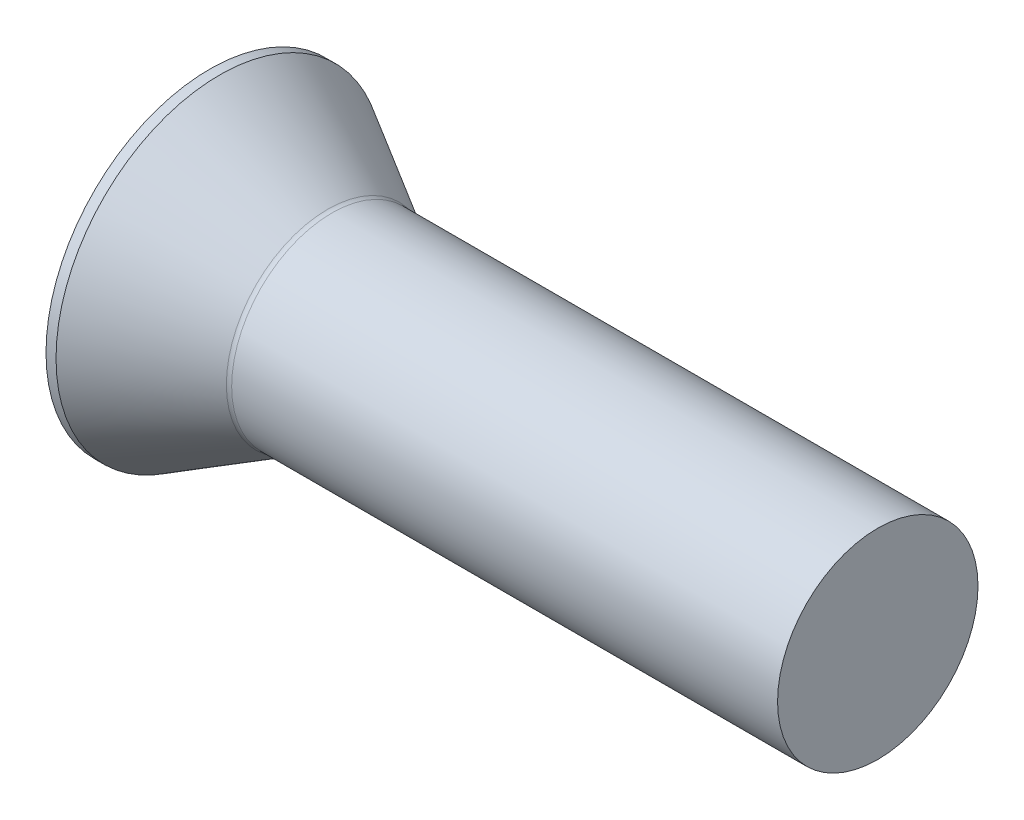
from build123d import *

# Parameters (mm, degrees)
FILLET1_R = 0.5


with BuildPart() as part:
    # Sketch1 → Base-Revolve (revolve)
    with BuildSketch(Plane(origin=(0, 0, 0), x_dir=(0, 1, 0), z_dir=(0, 0, 1)), mode=Mode.PRIVATE) as base_revolve_sk:
        Polygon((0, 0), (9.8, 0), (9.8, -0.6), (6, -7.181793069), (6, -40), (0, -40), align=None)
    revolve(base_revolve_sk.sketch.rotate(Axis((-2.03, 0, 0), (1, 0, 0)), 90), axis=Axis((-2.03, 0, 0), (1, 0, 0)))

    # Fillet1
    fillet1_edges = [part.edges().sort_by_distance(p)[0] for p in [
        (7.181793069, 0, -6),
    ]]
    fillet(fillet1_edges, radius=FILLET1_R)


solid = part.part
